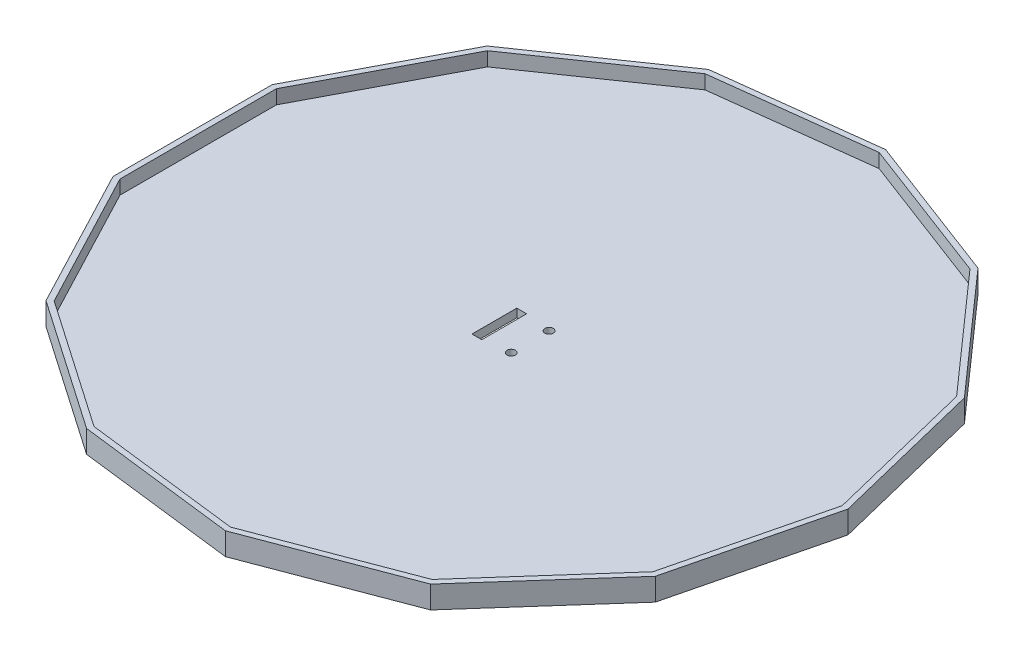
from build123d import *

# Parameters (mm, degrees)
WALLS_OF_ENCLOSURE_DEPTH  = 8
BOTTOM_OF_ENCLOSURE_DEPTH = 3
SKETCH11_R                = 1.5
SKETCH11_W                = 3.5
SKETCH11_H                = 16
SENSOR_HOLES_DEPTH        = 168.293800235


with BuildPart() as part:
    # Sketch5 → Walls of Enclosure (new body)
    with BuildSketch(Plane(origin=(0, 0, 0), x_dir=(1, 0, 0), z_dir=(0, 1, 0))):
        Polygon((-88.766478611, 78.640237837), (-115.14475414, 28.38063294), (-115.14475414, -28.38063294), (-88.766478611, -78.640237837), (-42.052872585, -110.884311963), (14.294539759, -117.726126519), (67.367245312, -97.598304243), (105.006926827, -55.111886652), (118.590786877, 0), (105.006926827, 55.111886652), (67.367245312, 97.598304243), (14.294539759, 117.726126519), (-42.052872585, 110.884311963), align=None)
        Polygon((116.530931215, 0), (103.183015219, 54.154623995), (66.197113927, 95.903076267), (14.046251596, 115.681289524), (-41.3224377, 108.958313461), (-87.224654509, 77.274300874), (-113.14475414, 27.887677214), (-113.14475414, -27.887677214), (-87.224654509, -77.274300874), (-41.3224377, -108.958313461), (14.046251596, -115.681289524), (66.197113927, -95.903076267), (103.183015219, -54.154623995), align=None, mode=Mode.SUBTRACT)
    extrude(amount=WALLS_OF_ENCLOSURE_DEPTH)

    # Sketch7 → Bottom of Enclosure (add)
    with BuildSketch(Plane(origin=(0, 0, 0), x_dir=(1, 0, 0), z_dir=(0, 1, 0))):
        Polygon((-42.052872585, 110.884311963), (-88.766478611, 78.640237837), (-115.14475414, 28.38063294), (-115.14475414, -28.38063294), (-88.766478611, -78.640237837), (-42.052872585, -110.884311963), (14.294539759, -117.726126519), (67.367245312, -97.598304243), (105.006926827, -55.111886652), (118.590786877, 0), (105.006926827, 55.111886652), (67.367245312, 97.598304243), (14.294539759, 117.726126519), align=None)
    extrude(amount=BOTTOM_OF_ENCLOSURE_DEPTH)

    # Sketch11 → Sensor Holes (cut, through all)
    with BuildSketch(Plane(origin=(0, 0, 0), x_dir=(1, 0, 0), z_dir=(0, 1, 0))):
        with Locations(Location((5.25, 6.75, 0), (0, 0, 270))):
            Circle(SKETCH11_R)
        with Locations(Location((5.25, -6.75, 0), (0, 0, 90))):
            Circle(SKETCH11_R)
        with Locations((-5.75, 0)):
            Rectangle(SKETCH11_W, SKETCH11_H)
    extrude(amount=SENSOR_HOLES_DEPTH, mode=Mode.SUBTRACT)


solid = part.part
